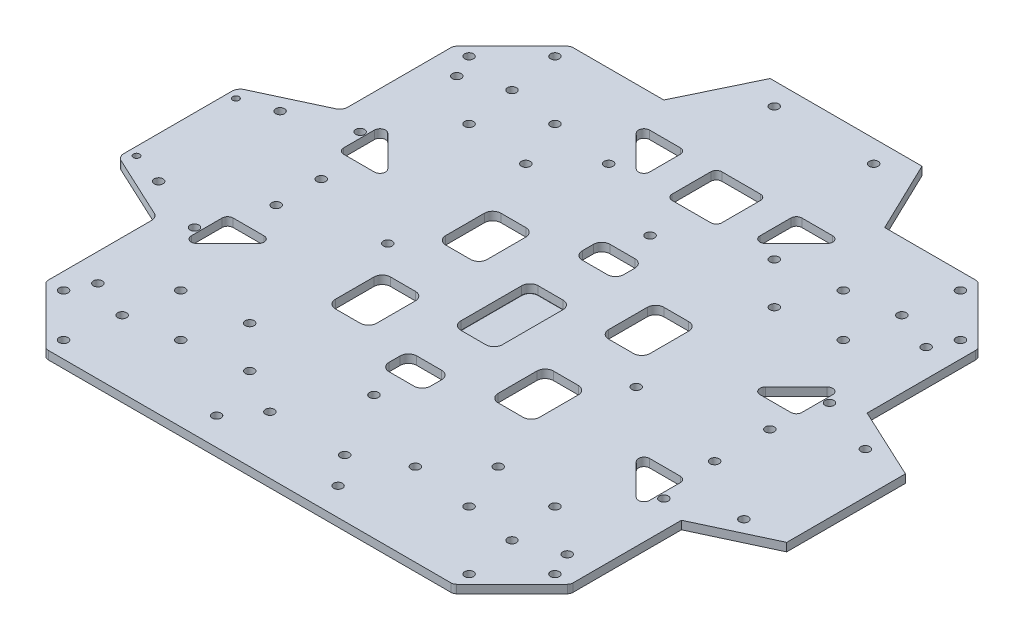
from build123d import *

# Parameters (mm, degrees)
SKETCH_1_R             = 1.6
EXTRUDE_1_DEPTH        = 3
FILLET_1_R             = 2
SKETCH_2_W             = 18
SKETCH_2_H             = 18
CUT_EXTRUDE_1_DEPTH    = 135.383778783
FILLET_2_R             = 2
EXTRUDE_2_DEPTH        = 3
FILLET_3_R             = 3
SKETCH_5_R             = 1.6
SKETCH_5_W             = 15
SKETCH_5_H             = 20
SKETCH_5_H_2           = 28
SKETCH_5_H_3           = 10
CUT_EXTRUDE_3_DEPTH    = 10
FILLET_4_R             = 3
SKETCH_6_R             = 1.15
CUT_EXTRUDE_8568_DEPTH = 10
SKETCH_7_R             = 1.6
EXTRUDE_3_DEPTH        = 3
SKETCH_8_R             = 1.6
CUT_EXTRUDE_4_DEPTH    = 40
SKETCH_9_R             = 1.6
CUT_EXTRUDE_5_DEPTH    = 10
EXTRUDE_4_DEPTH        = 3
SKETCH_11_W            = 25
SKETCH_11_H            = 35
EXTRUDE_5_DEPTH        = 3
FILLET_5_R             = 3


with BuildPart() as part:
    # Sketch 1 → Extrude 1 (new body)
    with BuildSketch(Plane(origin=(0, 0, 0), x_dir=(1, 0, 0), z_dir=(0, 1, 0))):
        Polygon((95, -73.786796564), (95, 73.786796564), (73.786796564, 95), (-73.786796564, 95), (-95, 73.786796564), (-95, -73.786796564), (-73.786796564, -95), (73.786796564, -95), align=None)
        with Locations(Location((-88.98959236, -73.433243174, 0), (0, 0, 270))):
            Circle(SKETCH_1_R, mode=Mode.SUBTRACT)
        with Locations(Location((-73.433243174, -88.98959236, 0), (0, 0, 270))):
            Circle(SKETCH_1_R, mode=Mode.SUBTRACT)
        with Locations(Location((-73.433243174, 88.98959236, 0), (0, 0, 270))):
            Circle(SKETCH_1_R, mode=Mode.SUBTRACT)
        with Locations(Location((-88.98959236, 73.433243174, 0), (0, 0, 270))):
            Circle(SKETCH_1_R, mode=Mode.SUBTRACT)
        with Locations(Location((73.433243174, 88.98959236, 0), (0, 0, 270))):
            Circle(SKETCH_1_R, mode=Mode.SUBTRACT)
        with Locations(Location((88.98959236, 73.433243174, 0), (0, 0, 270))):
            Circle(SKETCH_1_R, mode=Mode.SUBTRACT)
        with Locations(Location((88.98959236, -73.433243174, 0), (0, 0, 270))):
            Circle(SKETCH_1_R, mode=Mode.SUBTRACT)
        with Locations(Location((73.433243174, -88.98959236, 0), (0, 0, 270))):
            Circle(SKETCH_1_R, mode=Mode.SUBTRACT)
        with Locations(Location((-67.776388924, -52.220039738, 0), (0, 0, 270))):
            Circle(SKETCH_1_R, mode=Mode.SUBTRACT)
        with Locations(Location((-52.220039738, -67.776388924, 0), (0, 0, 270))):
            Circle(SKETCH_1_R, mode=Mode.SUBTRACT)
        with Locations(Location((67.776388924, -52.220039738, 0), (0, 0, 270))):
            Circle(SKETCH_1_R, mode=Mode.SUBTRACT)
        with Locations(Location((52.220039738, -67.776388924, 0), (0, 0, 270))):
            Circle(SKETCH_1_R, mode=Mode.SUBTRACT)
        with Locations(Location((67.776388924, 52.220039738, 0), (0, 0, 270))):
            Circle(SKETCH_1_R, mode=Mode.SUBTRACT)
        with Locations(Location((52.220039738, 67.776388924, 0), (0, 0, 270))):
            Circle(SKETCH_1_R, mode=Mode.SUBTRACT)
        with Locations(Location((-67.776388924, 52.220039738, 0), (0, 0, 270))):
            Circle(SKETCH_1_R, mode=Mode.SUBTRACT)
        with Locations(Location((-52.220039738, 67.776388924, 0), (0, 0, 270))):
            Circle(SKETCH_1_R, mode=Mode.SUBTRACT)
        with Locations(Location((-70.604816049, -70.604816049, 0), (0, 0, 270))):
            Circle(SKETCH_1_R, mode=Mode.SUBTRACT)
        with Locations(Location((-70.604816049, 70.604816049, 0), (0, 0, 270))):
            Circle(SKETCH_1_R, mode=Mode.SUBTRACT)
        with Locations(Location((70.604816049, -70.604816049, 0), (0, 0, 270))):
            Circle(SKETCH_1_R, mode=Mode.SUBTRACT)
        with Locations(Location((70.604816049, 70.604816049, 0), (0, 0, 270))):
            Circle(SKETCH_1_R, mode=Mode.SUBTRACT)
    extrude(amount=EXTRUDE_1_DEPTH)

    # Fillet 1
    fillet_1_edges = [part.edges().sort_by_distance(p)[0] for p in [
        (-73.786796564, 1.5, 95),
        (-95, 1.5, 73.786796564),
        (-95, 1.5, -73.786796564),
        (-73.786796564, 1.5, -95),
        (73.786796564, 1.5, -95),
        (95, 1.5, -73.786796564),
        (95, 1.5, 73.786796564),
        (73.786796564, 1.5, 95),
    ]]
    fillet(fillet_1_edges, radius=FILLET_1_R)

    # Sketch 2 → Cut-Extrude 1 (cut, through all)
    with BuildSketch(Plane(origin=(0, 3, 0), x_dir=(1, 0, 0), z_dir=(0, 1, 0))):
        Polygon((-65, 20), (-83, 38), (-83, 20), align=None)
        Polygon((-83, -38), (-83, -20), (-65, -20), align=None)
        Polygon((20, 65), (38, 83), (20, 83), align=None)
        Polygon((-38, 83), (-20, 83), (-20, 65), align=None)
        with Locations((0, 74)):
            Rectangle(SKETCH_2_W, SKETCH_2_H)
        Polygon((65, -20), (83, -38), (83, -20), align=None)
        Polygon((83, 38), (83, 20), (65, 20), align=None)
    extrude(amount=-CUT_EXTRUDE_1_DEPTH, mode=Mode.SUBTRACT)

    # Fillet 2
    fillet_2_edges = [part.edges().sort_by_distance(p)[0] for p in [
        (65, 1.5, -20),
        (83, 1.5, -38),
        (83, 1.5, -20),
        (65, 1.5, 20),
        (83, 1.5, 20),
        (83, 1.5, 38),
        (-65, 1.5, 20),
        (-83, 1.5, 38),
        (-83, 1.5, 20),
        (20, 1.5, -65),
        (20, 1.5, -83),
        (38, 1.5, -83),
        (-20, 1.5, -65),
        (-38, 1.5, -83),
        (-20, 1.5, -83),
        (9, 1.5, -83),
        (9, 1.5, -65),
        (-9, 1.5, -65),
        (-9, 1.5, -83),
        (-65, 1.5, -20),
        (-83, 1.5, -20),
        (-83, 1.5, -38),
    ]]
    fillet(fillet_2_edges, radius=FILLET_2_R)

    # Sketch 4 → Extrude 2 (add)
    with BuildSketch(Plane(origin=(0, 3, 0), x_dir=(1, 0, 0), z_dir=(0, 1, 0))):
        Polygon((-121, -21.5), (-95, -33.623999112), (-95, -21.5), (-95, 21.5), (-95, 33.623999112), (-121, 21.5), align=None)
        Polygon((95, 33.623999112), (95, 21.5), (95, -21.5), (95, -33.623999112), (121, -21.5), (121, 21.5), align=None)
    extrude(amount=-EXTRUDE_2_DEPTH)

    # Fillet 3
    fillet_3_edges = [part.edges().sort_by_distance(p)[0] for p in [
        (-95, 1.5, 33.623999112),
        (-121, 1.5, 21.5),
        (-121, 1.5, -21.5),
        (-95, 1.5, -33.623999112),
    ]]
    fillet(fillet_3_edges, radius=FILLET_3_R)

    # Sketch 5 → Cut-Extrude 3 (cut)
    with BuildSketch(Plane.XZ):
        with Locations(Location((-106, 22, 0), (0, 0, 90))):
            Circle(SKETCH_5_R)
        with Locations(Location((-106, -22, 0), (0, 0, 270))):
            Circle(SKETCH_5_R)
        with Locations(Location((106, -22, 0), (0, 0, 90))):
            Circle(SKETCH_5_R)
        with Locations(Location((106, 22, 0), (0, 0, 270))):
            Circle(SKETCH_5_R)
        with Locations(Location((82.5, -10.895903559, 0), (0, 0, 270))):
            Circle(SKETCH_5_R)
        with Locations(Location((82.5, 9.104096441, 0), (0, 0, 270))):
            Circle(SKETCH_5_R)
        with Locations(Location((-77.25, 8.16, 0), (0, 0, 270))):
            Circle(SKETCH_5_R)
        with Locations(Location((-77.25, -8.16, 0), (0, 0, 90))):
            Circle(SKETCH_5_R)
        with Locations(Location((13.55, 74.15, 0), (0, 0, 270))):
            Circle(SKETCH_5_R)
        with Locations(Location((-13.55, 74.15, 0), (0, 0, 270))):
            Circle(SKETCH_5_R)
        with Locations((-29.5, -20)):
            Rectangle(SKETCH_5_W, SKETCH_5_H)
        Rectangle(SKETCH_5_W, SKETCH_5_H_2)
        with Locations((-29.5, 20)):
            Rectangle(SKETCH_5_W, SKETCH_5_H)
        with Locations((29.5, 20)):
            Rectangle(SKETCH_5_W, SKETCH_5_H)
        with Locations((29.5, -20)):
            Rectangle(SKETCH_5_W, SKETCH_5_H)
        with Locations((0, -35)):
            Rectangle(SKETCH_5_W, SKETCH_5_H_3)
        with Locations((0, 35)):
            Rectangle(SKETCH_5_W, SKETCH_5_H_3)
    extrude(amount=-CUT_EXTRUDE_3_DEPTH, mode=Mode.SUBTRACT)

    # Fillet 4
    fillet_4_edges = [part.edges().sort_by_distance(p)[0] for p in [
        (-7.5, 1.5, -40),
        (-7.5, 1.5, -30),
        (7.5, 1.5, -30),
        (7.5, 1.5, -40),
        (37, 1.5, -30),
        (22, 1.5, -30),
        (22, 1.5, -10),
        (37, 1.5, -10),
        (-37, 1.5, -30),
        (-37, 1.5, -10),
        (-22, 1.5, -10),
        (-22, 1.5, -30),
        (37, 1.5, 30),
        (37, 1.5, 10),
        (22, 1.5, 10),
        (22, 1.5, 30),
        (7.5, 1.5, 40),
        (7.5, 1.5, 30),
        (-7.5, 1.5, 30),
        (-7.5, 1.5, 40),
        (7.5, 1.5, 14),
        (7.5, 1.5, -14),
        (-7.5, 1.5, -14),
        (-7.5, 1.5, 14),
        (-37, 1.5, 10),
        (-37, 1.5, 30),
        (-22, 1.5, 30),
        (-22, 1.5, 10),
    ]]
    fillet(fillet_4_edges, radius=FILLET_4_R)

    # Sketch 6 → Cut-Extrude 8568 (cut)
    with BuildSketch(Plane.XZ):
        with Locations(Location((-118, 18, 0), (0, 0, 270))):
            Circle(SKETCH_6_R)
        with Locations(Location((-118, -18, 0), (0, 0, 270))):
            Circle(SKETCH_6_R)
    extrude(amount=-CUT_EXTRUDE_8568_DEPTH, mode=Mode.SUBTRACT)

    # Sketch 7 → Extrude 3 (add)
    with BuildSketch(Plane(origin=(0, 3, 0), x_dir=(1, 0, 0), z_dir=(0, 1, 0))):
        Polygon((-40, 95), (-27.5, 121), (27.5, 121), (40, 95), align=None)
        with Locations(Location((18, 113, 0), (0, 0, 270))):
            Circle(SKETCH_7_R, mode=Mode.SUBTRACT)
        with Locations(Location((-18, 113, 0), (0, 0, 270))):
            Circle(SKETCH_7_R, mode=Mode.SUBTRACT)
    extrude(amount=-EXTRUDE_3_DEPTH)

    # Sketch 8 → Cut-Extrude 4 (cut)
    with BuildSketch(Plane.XZ):
        with Locations(Location((22, 85, 0), (0, 0, 270))):
            Circle(SKETCH_8_R)
        with Locations(Location((-22, 85, 0), (0, 0, 270))):
            Circle(SKETCH_8_R)
    extrude(amount=-CUT_EXTRUDE_4_DEPTH, mode=Mode.SUBTRACT)

    # Sketch 9 → Cut-Extrude 5 (cut)
    with BuildSketch(Plane.XZ):
        with Locations(Location((-45, -50, 0), (0, 0, 270))):
            Circle(SKETCH_9_R)
        with Locations(Location((45, -50, 0), (0, 0, 270))):
            Circle(SKETCH_9_R)
        with Locations(Location((0, -50, 0), (0, 0, 270))):
            Circle(SKETCH_9_R)
        with Locations(Location((-45, 0, 0), (0, 0, 270))):
            Circle(SKETCH_9_R)
        with Locations(Location((-45, 50, 0), (0, 0, 270))):
            Circle(SKETCH_9_R)
        with Locations(Location((0, 50, 0), (0, 0, 270))):
            Circle(SKETCH_9_R)
        with Locations(Location((45, 50, 0), (0, 0, 270))):
            Circle(SKETCH_9_R)
        with Locations(Location((45, 0, 0), (0, 0, 270))):
            Circle(SKETCH_9_R)
        with Locations(Location((85, 65, 0), (0, 0, 270))):
            Circle(SKETCH_9_R)
        with Locations(Location((-85, 65, 0), (0, 0, 270))):
            Circle(SKETCH_9_R)
        with Locations(Location((-85, -65, 0), (0, 0, 270))):
            Circle(SKETCH_9_R)
        with Locations(Location((85, -65, 0), (0, 0, 270))):
            Circle(SKETCH_9_R)
        with Locations(Location((30, -65, 0), (0, 0, 270))):
            Circle(SKETCH_9_R)
        with Locations(Location((-30, -65, 0), (0, 0, 270))):
            Circle(SKETCH_9_R)
        with Locations(Location((30, 65, 0), (0, 0, 270))):
            Circle(SKETCH_9_R)
        with Locations(Location((-30, 65, 0), (0, 0, 270))):
            Circle(SKETCH_9_R)
        with Locations(Location((85, 30, 0), (0, 0, 270))):
            Circle(SKETCH_9_R)
        with Locations(Location((85, -30, 0), (0, 0, 270))):
            Circle(SKETCH_9_R)
        with Locations(Location((-85, -30, 0), (0, 0, 270))):
            Circle(SKETCH_9_R)
        with Locations(Location((-85, 30, 0), (0, 0, 270))):
            Circle(SKETCH_9_R)
    extrude(amount=-CUT_EXTRUDE_5_DEPTH, mode=Mode.SUBTRACT)


with BuildPart() as body_2:
    # Sketch 10 → Extrude 4 (new body)
    with BuildSketch(Plane.XZ):
        with BuildLine():
            Line((7.4, -11), (7.4, 11))
            ThreePointArc((7.4, 11), (6.550609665, 13.050609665), (4.5, 13.9))
            Line((4.5, 13.9), (-4.5, 13.9))
            ThreePointArc((-4.5, 13.9), (-6.550609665, 13.050609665), (-7.4, 11))
            Line((-7.4, 11), (-7.4, -11))
            ThreePointArc((-7.4, -11), (-6.550609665, -13.050609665), (-4.5, -13.9))
            Line((-4.5, -13.9), (4.5, -13.9))
            ThreePointArc((4.5, -13.9), (6.550609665, -13.050609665), (7.4, -11))
        make_face()
    extrude(amount=EXTRUDE_4_DEPTH)

    # Sketch 11 → Extrude 5 (add)
    with BuildSketch(Plane.XZ.offset(3)):
        Rectangle(SKETCH_11_W, SKETCH_11_H)
    extrude(amount=EXTRUDE_5_DEPTH)

    # Fillet 5
    fillet_5_edges = [body_2.edges().sort_by_distance(p)[0] for p in [
        (12.5, -4.5, -17.5),
        (12.5, -4.5, 17.5),
        (-12.5, -4.5, 17.5),
        (-12.5, -4.5, -17.5),
    ]]
    fillet(fillet_5_edges, radius=FILLET_5_R)


solid = Compound([part.part, body_2.part])
